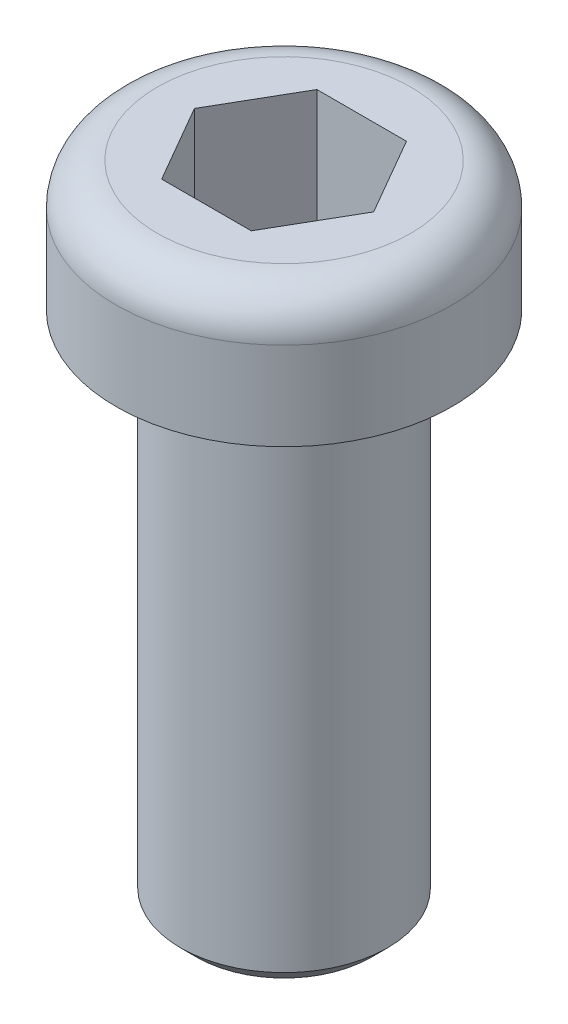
from build123d import *

# Parameters (mm, degrees)
ENL_V_MAT_EXTRU_1_DEPTH = 5


with BuildPart() as part:
    # Esquisse1 → R_volution1 (revolve)
    with BuildSketch(Plane.XY, mode=Mode.PRIVATE) as r_volution1_sk:
        with BuildLine():
            Line((0, 5), (4.9, 5))
            ThreePointArc((4.9, 5), (6.03137085, 4.53137085), (6.5, 3.4))
            Line((6.5, 3.4), (6.5, 0))
            Line((6.5, 0), (4.4, 0))
            ThreePointArc((4.4, 0), (4.117157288, -0.117157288), (4, -0.4))
            Line((4, -0.4), (4, -19.375))
            Line((4, -19.375), (3.375, -20))
            Line((3.375, -20), (0, -20))
            Line((0, -20), (0, 5))
        make_face()
    revolve(r_volution1_sk.sketch.rotate(Axis((0, 5, 0), (0, -1, 0)), 180), axis=Axis((0, 5, 0), (0, -1, 0)))

    # Esquisse2 → Enl_v. mat.-Extru.1 (cut)
    with BuildSketch(Plane(origin=(0, 5, 0), x_dir=(1, 0, 0), z_dir=(0, 1, 0))):
        Polygon((3.464101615, 0), (1.732050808, 3), (-1.732050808, 3), (-3.464101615, 0), (-1.732050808, -3), (1.732050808, -3), align=None)
    extrude(amount=-ENL_V_MAT_EXTRU_1_DEPTH, mode=Mode.SUBTRACT)


solid = part.part
